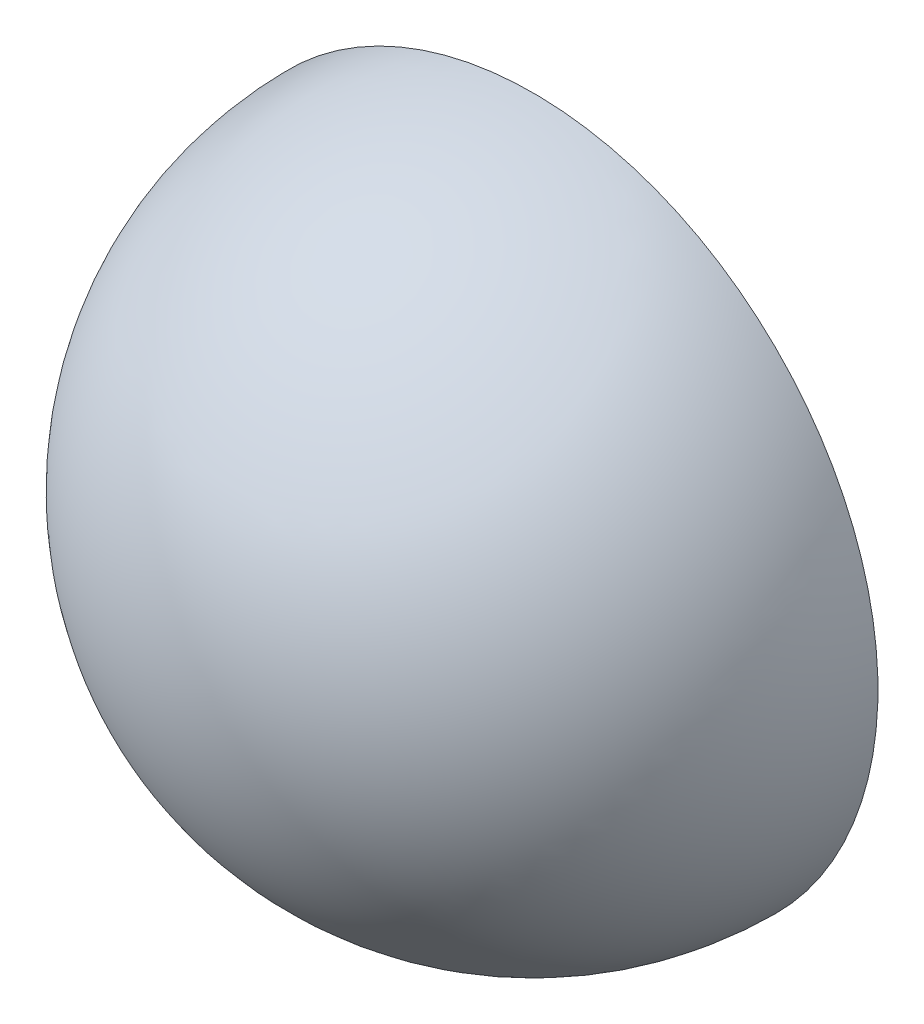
from build123d import *

# Parameters (mm, degrees)
REVOLVE1_ANGLE = 180


with BuildPart() as part:
    # Sketch1 → Revolve1 (revolve)
    with BuildSketch(Plane.XY):
        with BuildLine():
            Line((0, 38.1), (0, 34.358167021))
            ThreePointArc((0, 34.358167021), (34.358167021, 0), (0, -34.358167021))
            Line((0, -34.358167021), (0, -38.1))
            ThreePointArc((0, -38.1), (38.1, 0), (0, 38.1))
        make_face()
    revolve(axis=Axis((0, 38.1, 0), (0, -1, 0)), revolution_arc=REVOLVE1_ANGLE)


solid = part.part
